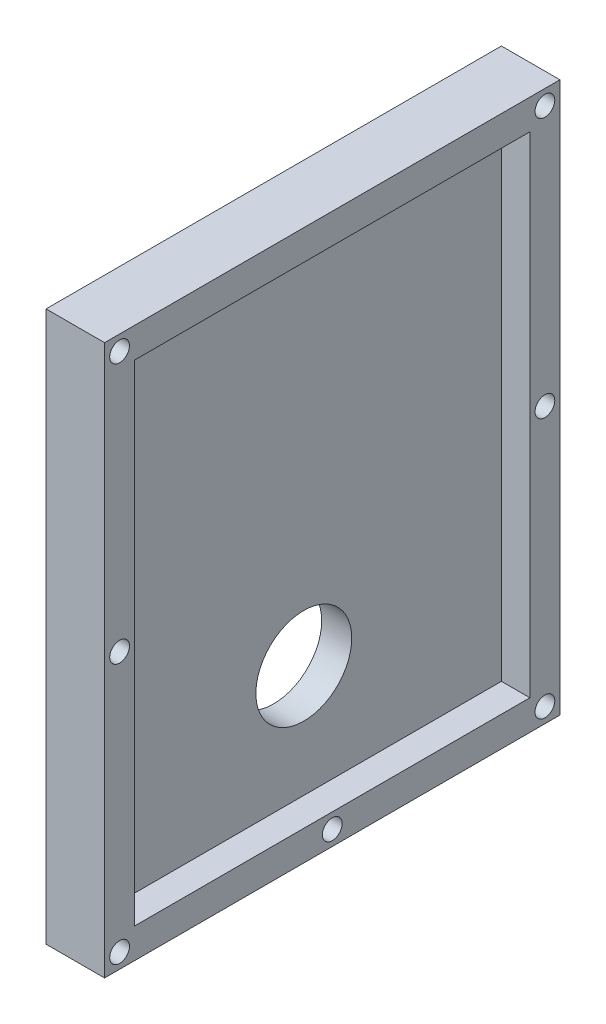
from build123d import *

# Parameters (mm, degrees)
SKETCH2_W           = 39.37
SKETCH2_H           = 31.75
BOSS_EXTRUDE1_DEPTH = 2.286
SHELL1_T            = 2.413
SKETCH4_R           = 3.850916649
CUT_EXTRUDE1_DEPTH  = 55.025477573
SKETCH5_R           = 0.79375
CUT_EXTRUDE2_DEPTH  = 55.175734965


with BuildPart() as part:
    # Sketch2 → Boss-Extrude1 (new body)
    with BuildSketch(Plane.YZ):
        with Locations((19.685, 15.875)):
            Rectangle(SKETCH2_W, SKETCH2_H)
    extrude(amount=BOSS_EXTRUDE1_DEPTH)

    # Shell1
    shell1_openings = [part.faces().sort_by_distance(p)[0] for p in [
        (2.286, 19.685, 15.875),
    ]]
    offset(amount=SHELL1_T, openings=shell1_openings, kind=Kind.INTERSECTION)

    # Sketch4 → Cut-Extrude1 (cut, through all)
    with BuildSketch(Plane.YZ):
        with Locations(Location((9.017, 15.875, 0), (0, 0, 270))):
            Circle(SKETCH4_R)
    extrude(amount=-CUT_EXTRUDE1_DEPTH, mode=Mode.SUBTRACT)

    # Sketch5 → Cut-Extrude2 (cut, through all)
    with BuildSketch(Plane(origin=(2.286, 0, 0), x_dir=(0, 0, -1), z_dir=(1, 0, 0))):
        with Locations((-32.9565, -1.2065)):
            Circle(SKETCH5_R)
        with Locations((-32.9565, 19.685)):
            Circle(SKETCH5_R)
        with Locations((-32.9565, 40.5765)):
            Circle(SKETCH5_R)
        with Locations((1.2065, 40.5765)):
            Circle(SKETCH5_R)
        with Locations((1.2065, 19.685)):
            Circle(SKETCH5_R)
        with Locations((1.2065, -1.2065)):
            Circle(SKETCH5_R)
        with Locations((-15.875, -1.2065)):
            Circle(SKETCH5_R)
    extrude(amount=-CUT_EXTRUDE2_DEPTH, mode=Mode.SUBTRACT)


solid = part.part
